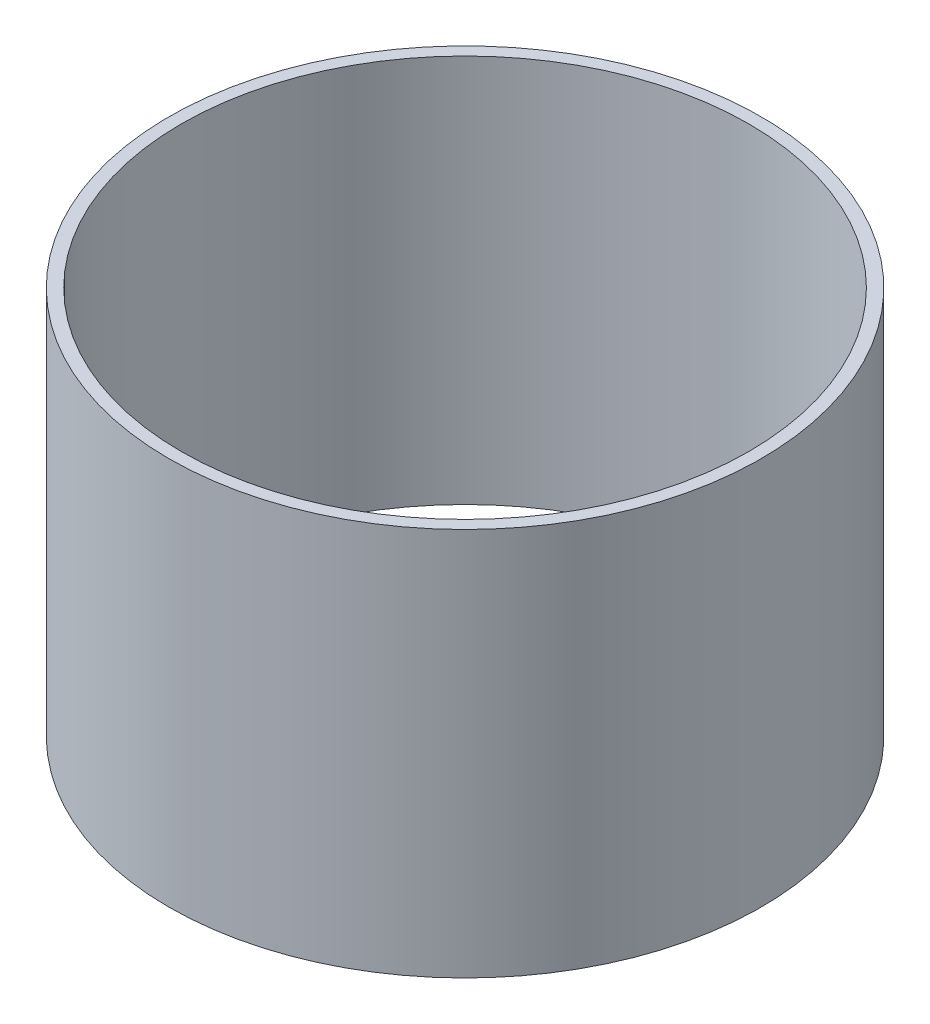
from build123d import *

# Parameters (mm, degrees)
SKETCH1_R      = 152.4
SKETCH1_R_2    = 146.05
EXTRUDE1_DEPTH = 199.898


with BuildPart() as part:
    # Sketch1 → Extrude1 (new body)
    with BuildSketch(Plane(origin=(0, 0, 0), x_dir=(1, 0, 0), z_dir=(0, 1, 0))):
        with Locations(Location((0, 0, 0), (0, 0, 270))):
            Circle(SKETCH1_R)
        with Locations(Location((0, 0, 0), (0, 0, 270))):
            Circle(SKETCH1_R_2, mode=Mode.SUBTRACT)
    extrude(amount=EXTRUDE1_DEPTH)


solid = part.part
